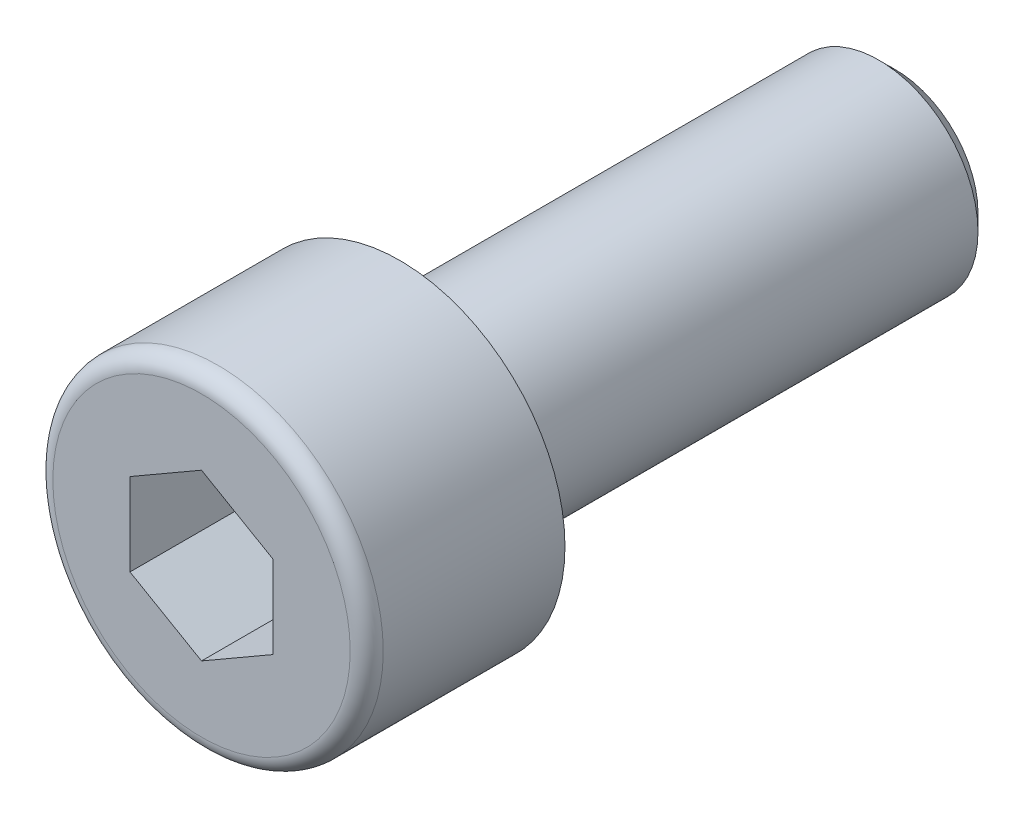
from build123d import *

# Parameters (mm, degrees)
ESQUISSE1_R             = 3
BASE_EXTRUSION_DEPTH    = 21
CHANFREIN1_SIZE         = 0.5
ESQUISSE2_R             = 5
BOSS_EXTRU_1_DEPTH      = 6
ENL_V_MAT_EXTRU_1_DEPTH = 3.5
CONG_2_R                = 0.5


with BuildPart() as part:
    # Esquisse1 → Base-Extrusion (new body)
    with BuildSketch(Plane.XY):
        Circle(ESQUISSE1_R)
    extrude(amount=BASE_EXTRUSION_DEPTH)

    # Chanfrein1
    chanfrein1_edges = [part.edges().sort_by_distance(p)[0] for p in [
        (-3, 0, 0),
    ]]
    chamfer(chanfrein1_edges, length=CHANFREIN1_SIZE)

    # Esquisse2 → Boss.-Extru.1 (add)
    with BuildSketch(Plane.XY.offset(15)):
        Circle(ESQUISSE2_R)
    extrude(amount=BOSS_EXTRU_1_DEPTH)

    # Esquisse3 → Enl_v. mat.-Extru.1 (cut)
    with BuildSketch(Plane.XY.offset(21)):
        Polygon((0, 2.5), (-2.165063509, 1.25), (-2.165063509, -1.25), (0, -2.5), (2.165063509, -1.25), (2.165063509, 1.25), align=None)
    extrude(amount=-ENL_V_MAT_EXTRU_1_DEPTH, mode=Mode.SUBTRACT)

    # Cong_2
    cong_2_edges = [part.edges().sort_by_distance(p)[0] for p in [
        (-5, 0, 21),
    ]]
    fillet(cong_2_edges, radius=CONG_2_R)


solid = part.part
